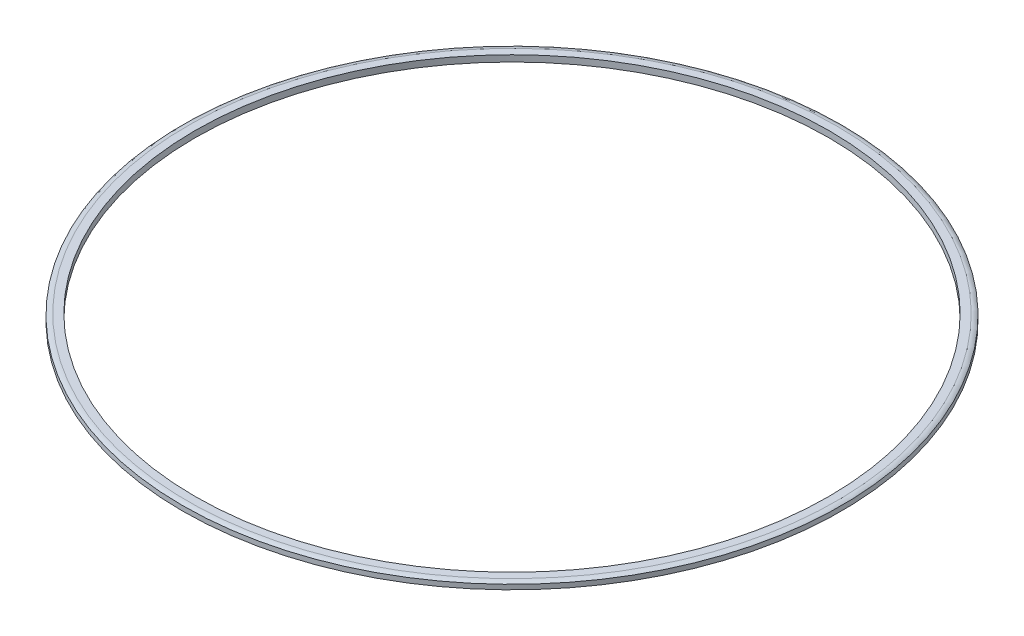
ISO-10303-21;
HEADER;
FILE_DESCRIPTION(('STEP AP214'),'2;1');
FILE_NAME('part.step','',(''),(''),'','','');
FILE_SCHEMA(('AUTOMOTIVE_DESIGN { 1 0 10303 214 1 1 1 1 }'));
ENDSEC;
DATA;
#1=APPLICATION_CONTEXT('core data for automotive mechanical design processes');
#2=APPLICATION_PROTOCOL_DEFINITION('international standard','automotive_design',2000,#1);
#3=PRODUCT_CONTEXT('',#1,'mechanical');
#4=PRODUCT('Part','Part','',(#3));
#5=PRODUCT_RELATED_PRODUCT_CATEGORY('part','',(#4));
#6=PRODUCT_DEFINITION_FORMATION('','',#4);
#7=PRODUCT_DEFINITION_CONTEXT('part definition',#1,'design');
#8=PRODUCT_DEFINITION('design','',#6,#7);
#9=PRODUCT_DEFINITION_SHAPE('','',#8);
#10=(LENGTH_UNIT() NAMED_UNIT(*) SI_UNIT(.MILLI.,.METRE.));
#11=(NAMED_UNIT(*) PLANE_ANGLE_UNIT() SI_UNIT($,.RADIAN.));
#12=(NAMED_UNIT(*) SI_UNIT($,.STERADIAN.) SOLID_ANGLE_UNIT());
#13=UNCERTAINTY_MEASURE_WITH_UNIT(LENGTH_MEASURE(1.E-05),#10,'distance_accuracy_value','');
#14=(GEOMETRIC_REPRESENTATION_CONTEXT(3) GLOBAL_UNCERTAINTY_ASSIGNED_CONTEXT((#13)) GLOBAL_UNIT_ASSIGNED_CONTEXT((#10,
#11,#12)) REPRESENTATION_CONTEXT('',''));
#15=CARTESIAN_POINT('',(0.,0.,0.));
#16=DIRECTION('',(0.,0.,1.));
#17=DIRECTION('',(1.,0.,0.));
#18=AXIS2_PLACEMENT_3D('',#15,#16,#17);
#19=CARTESIAN_POINT('',(-300.911,0.,0.));
#20=DIRECTION('',(0.,1.,0.));
#21=DIRECTION('',(0.,0.,1.));
#22=AXIS2_PLACEMENT_3D('',#19,#20,#21);
#23=PLANE('',#22);
#24=CARTESIAN_POINT('',(0.,0.,0.));
#25=DIRECTION('',(0.,1.,0.));
#26=DIRECTION('',(0.,0.,1.));
#27=AXIS2_PLACEMENT_3D('',#24,#25,#26);
#28=CIRCLE('',#27,305.871);
#29=CARTESIAN_POINT('',(0.,0.,305.871));
#30=VERTEX_POINT('',#29);
#31=EDGE_CURVE('E55',#30,#30,#28,.T.);
#32=ORIENTED_EDGE('',*,*,#31,.F.);
#33=EDGE_LOOP('',(#32));
#34=FACE_BOUND('',#33,.T.);
#35=CARTESIAN_POINT('',(0.,0.,0.));
#36=DIRECTION('',(0.,-1.,0.));
#37=DIRECTION('',(0.,0.,-1.));
#38=AXIS2_PLACEMENT_3D('',#35,#36,#37);
#39=CIRCLE('',#38,300.911);
#40=CARTESIAN_POINT('',(0.,0.,-300.911));
#41=VERTEX_POINT('',#40);
#42=EDGE_CURVE('E52',#41,#41,#39,.T.);
#43=ORIENTED_EDGE('',*,*,#42,.F.);
#44=EDGE_LOOP('',(#43));
#45=FACE_BOUND('',#44,.T.);
#46=ADVANCED_FACE('F32',(#34,#45),#23,.F.);
#47=CARTESIAN_POINT('',(0.,-40.8119344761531,0.));
#48=DIRECTION('',(0.,-1.,0.));
#49=DIRECTION('',(0.,0.,-1.));
#50=AXIS2_PLACEMENT_3D('',#47,#48,#49);
#51=CYLINDRICAL_SURFACE('',#50,300.911);
#52=CARTESIAN_POINT('',(0.,5.99999999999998,0.));
#53=DIRECTION('',(0.,-1.,0.));
#54=DIRECTION('',(0.,0.,-1.));
#55=AXIS2_PLACEMENT_3D('',#52,#53,#54);
#56=CIRCLE('',#55,300.911);
#57=CARTESIAN_POINT('',(0.,5.99999999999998,-300.911));
#58=VERTEX_POINT('',#57);
#59=EDGE_CURVE('E10',#58,#58,#56,.T.);
#60=ORIENTED_EDGE('',*,*,#59,.F.);
#61=EDGE_LOOP('',(#60));
#62=FACE_BOUND('',#61,.T.);
#63=ORIENTED_EDGE('',*,*,#42,.T.);
#64=EDGE_LOOP('',(#63));
#65=FACE_BOUND('',#64,.T.);
#66=ADVANCED_FACE('F34',(#62,#65),#51,.F.);
#67=CARTESIAN_POINT('',(-300.911,5.99999999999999,0.));
#68=DIRECTION('',(0.,-1.,0.));
#69=DIRECTION('',(0.,0.,-1.));
#70=AXIS2_PLACEMENT_3D('',#67,#68,#69);
#71=PLANE('',#70);
#72=CARTESIAN_POINT('',(0.,6.,0.));
#73=DIRECTION('',(0.,-1.,0.));
#74=DIRECTION('',(0.,0.,-1.));
#75=AXIS2_PLACEMENT_3D('',#72,#73,#74);
#76=CIRCLE('',#75,308.325);
#77=CARTESIAN_POINT('',(0.,6.,-308.325));
#78=VERTEX_POINT('',#77);
#79=EDGE_CURVE('E39',#78,#78,#76,.T.);
#80=ORIENTED_EDGE('',*,*,#79,.F.);
#81=EDGE_LOOP('',(#80));
#82=FACE_BOUND('',#81,.T.);
#83=ORIENTED_EDGE('',*,*,#59,.T.);
#84=EDGE_LOOP('',(#83));
#85=FACE_BOUND('',#84,.T.);
#86=ADVANCED_FACE('F95',(#82,#85),#71,.F.);
#87=CARTESIAN_POINT('',(0.,-2.,0.));
#88=DIRECTION('',(0.,-1.,0.));
#89=DIRECTION('',(0.,0.,-1.));
#90=AXIS2_PLACEMENT_3D('',#87,#88,#89);
#91=TOROIDAL_SURFACE('',#90,308.325,8.);
#92=CARTESIAN_POINT('',(0.,4.55504416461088,0.));
#93=DIRECTION('',(0.,-1.,0.));
#94=DIRECTION('',(0.,0.,-1.));
#95=AXIS2_PLACEMENT_3D('',#92,#93,#94);
#96=CIRCLE('',#95,312.911);
#97=CARTESIAN_POINT('',(0.,4.55504416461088,-312.911));
#98=VERTEX_POINT('',#97);
#99=EDGE_CURVE('E43',#98,#98,#96,.T.);
#100=ORIENTED_EDGE('',*,*,#99,.F.);
#101=EDGE_LOOP('',(#100));
#102=FACE_BOUND('',#101,.T.);
#103=ORIENTED_EDGE('',*,*,#79,.T.);
#104=EDGE_LOOP('',(#103));
#105=FACE_BOUND('',#104,.T.);
#106=ADVANCED_FACE('F100',(#102,#105),#91,.T.);
#107=CARTESIAN_POINT('',(0.,-40.8119344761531,0.));
#108=DIRECTION('',(0.,-1.,0.));
#109=DIRECTION('',(0.,0.,-1.));
#110=AXIS2_PLACEMENT_3D('',#107,#108,#109);
#111=CYLINDRICAL_SURFACE('',#110,312.911);
#112=CARTESIAN_POINT('',(0.,0.,0.));
#113=DIRECTION('',(0.,-1.,0.));
#114=DIRECTION('',(0.,0.,-1.));
#115=AXIS2_PLACEMENT_3D('',#112,#113,#114);
#116=CIRCLE('',#115,312.911);
#117=CARTESIAN_POINT('',(0.,0.,-312.911));
#118=VERTEX_POINT('',#117);
#119=EDGE_CURVE('E47',#118,#118,#116,.T.);
#120=ORIENTED_EDGE('',*,*,#119,.F.);
#121=EDGE_LOOP('',(#120));
#122=FACE_BOUND('',#121,.T.);
#123=ORIENTED_EDGE('',*,*,#99,.T.);
#124=EDGE_LOOP('',(#123));
#125=FACE_BOUND('',#124,.T.);
#126=ADVANCED_FACE('F105',(#122,#125),#111,.T.);
#127=CARTESIAN_POINT('',(0.,0.,0.));
#128=DIRECTION('',(0.,1.,0.));
#129=DIRECTION('',(0.,0.,1.));
#130=AXIS2_PLACEMENT_3D('',#127,#128,#129);
#131=CIRCLE('',#130,308.917279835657);
#132=CARTESIAN_POINT('',(0.,0.,308.917279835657));
#133=VERTEX_POINT('',#132);
#134=EDGE_CURVE('E64',#133,#133,#131,.T.);
#135=ORIENTED_EDGE('',*,*,#134,.T.);
#136=EDGE_LOOP('',(#135));
#137=FACE_BOUND('',#136,.T.);
#138=ORIENTED_EDGE('',*,*,#119,.T.);
#139=EDGE_LOOP('',(#138));
#140=FACE_BOUND('',#139,.T.);
#141=ADVANCED_FACE('F68',(#137,#140),#23,.F.);
#142=CARTESIAN_POINT('',(0.,0.,0.));
#143=DIRECTION('',(0.,-1.,0.));
#144=DIRECTION('',(0.,0.,-1.));
#145=AXIS2_PLACEMENT_3D('',#142,#143,#144);
#146=CONICAL_SURFACE('',#145,305.871,0.17453292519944);
#147=CARTESIAN_POINT('',(0.,2.4790554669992,0.));
#148=DIRECTION('',(0.,1.,0.));
#149=DIRECTION('',(0.,0.,1.));
#150=AXIS2_PLACEMENT_3D('',#147,#148,#149);
#151=CIRCLE('',#150,305.433875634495);
#152=CARTESIAN_POINT('',(0.,2.4790554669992,305.433875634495));
#153=VERTEX_POINT('',#152);
#154=EDGE_CURVE('E58',#153,#153,#151,.T.);
#155=ORIENTED_EDGE('',*,*,#154,.F.);
#156=EDGE_LOOP('',(#155));
#157=FACE_BOUND('',#156,.T.);
#158=ORIENTED_EDGE('',*,*,#31,.T.);
#159=EDGE_LOOP('',(#158));
#160=FACE_BOUND('',#159,.T.);
#161=ADVANCED_FACE('F80',(#157,#160),#146,.T.);
#162=CARTESIAN_POINT('',(0.,2.4790554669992,0.));
#163=DIRECTION('',(0.,1.,0.));
#164=DIRECTION('',(0.,0.,1.));
#165=AXIS2_PLACEMENT_3D('',#162,#163,#164);
#166=CONICAL_SURFACE('',#165,305.433875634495,1.39626340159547);
#167=CARTESIAN_POINT('',(0.,2.99999999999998,0.));
#168=DIRECTION('',(0.,1.,0.));
#169=DIRECTION('',(0.,0.,1.));
#170=AXIS2_PLACEMENT_3D('',#167,#168,#169);
#171=CIRCLE('',#170,308.388298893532);
#172=CARTESIAN_POINT('',(0.,2.99999999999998,308.388298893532));
#173=VERTEX_POINT('',#172);
#174=EDGE_CURVE('E61',#173,#173,#171,.T.);
#175=ORIENTED_EDGE('',*,*,#174,.F.);
#176=EDGE_LOOP('',(#175));
#177=FACE_BOUND('',#176,.T.);
#178=ORIENTED_EDGE('',*,*,#154,.T.);
#179=EDGE_LOOP('',(#178));
#180=FACE_BOUND('',#179,.T.);
#181=ADVANCED_FACE('F74',(#177,#180),#166,.T.);
#182=CARTESIAN_POINT('',(0.,2.99999999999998,0.));
#183=DIRECTION('',(0.,-1.,0.));
#184=DIRECTION('',(0.,0.,-1.));
#185=AXIS2_PLACEMENT_3D('',#182,#183,#184);
#186=CONICAL_SURFACE('',#185,308.388298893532,0.174532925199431);
#187=ORIENTED_EDGE('',*,*,#134,.F.);
#188=EDGE_LOOP('',(#187));
#189=FACE_BOUND('',#188,.T.);
#190=ORIENTED_EDGE('',*,*,#174,.T.);
#191=EDGE_LOOP('',(#190));
#192=FACE_BOUND('',#191,.T.);
#193=ADVANCED_FACE('F71',(#189,#192),#186,.F.);
#194=CLOSED_SHELL('',(#46,#66,#86,#106,#126,#141,#161,#181,#193));
#195=MANIFOLD_SOLID_BREP('B2',#194);
#196=ADVANCED_BREP_SHAPE_REPRESENTATION('',(#18,#195),#14);
#197=SHAPE_DEFINITION_REPRESENTATION(#9,#196);
ENDSEC;
END-ISO-10303-21;
